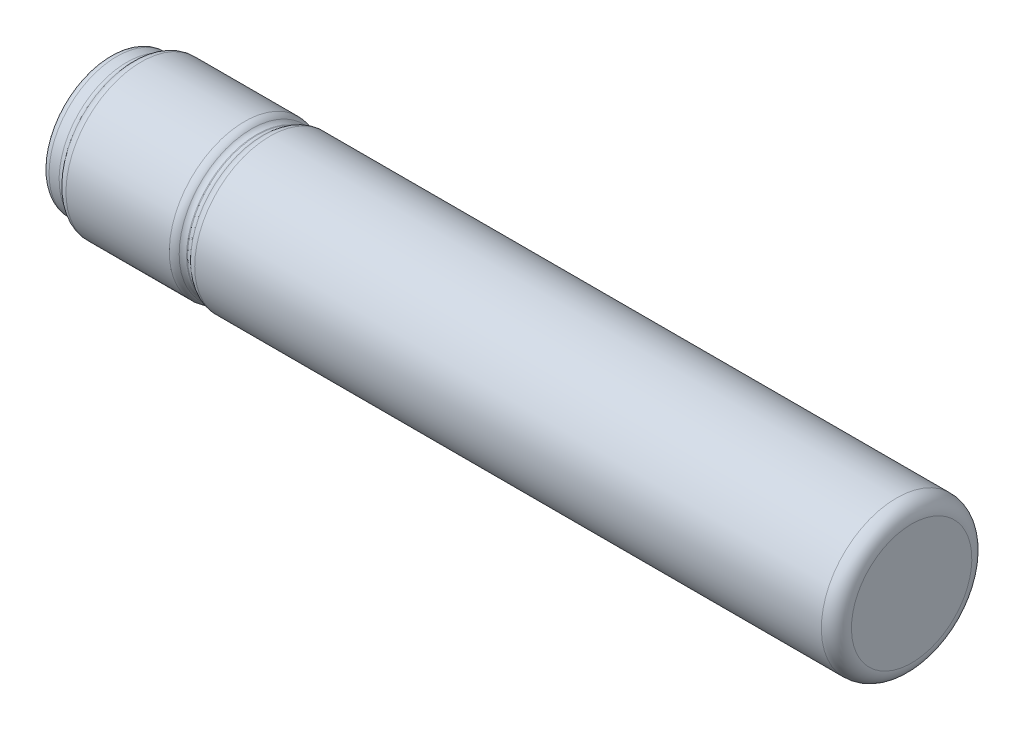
ISO-10303-21;
HEADER;
FILE_DESCRIPTION(('STEP AP214'),'2;1');
FILE_NAME('part.step','',(''),(''),'','','');
FILE_SCHEMA(('AUTOMOTIVE_DESIGN { 1 0 10303 214 1 1 1 1 }'));
ENDSEC;
DATA;
#1=APPLICATION_CONTEXT('core data for automotive mechanical design processes');
#2=APPLICATION_PROTOCOL_DEFINITION('international standard','automotive_design',2000,#1);
#3=PRODUCT_CONTEXT('',#1,'mechanical');
#4=PRODUCT('Part','Part','',(#3));
#5=PRODUCT_RELATED_PRODUCT_CATEGORY('part','',(#4));
#6=PRODUCT_DEFINITION_FORMATION('','',#4);
#7=PRODUCT_DEFINITION_CONTEXT('part definition',#1,'design');
#8=PRODUCT_DEFINITION('design','',#6,#7);
#9=PRODUCT_DEFINITION_SHAPE('','',#8);
#10=(LENGTH_UNIT() NAMED_UNIT(*) SI_UNIT(.MILLI.,.METRE.));
#11=(NAMED_UNIT(*) PLANE_ANGLE_UNIT() SI_UNIT($,.RADIAN.));
#12=(NAMED_UNIT(*) SI_UNIT($,.STERADIAN.) SOLID_ANGLE_UNIT());
#13=UNCERTAINTY_MEASURE_WITH_UNIT(LENGTH_MEASURE(1.E-05),#10,'distance_accuracy_value','');
#14=(GEOMETRIC_REPRESENTATION_CONTEXT(3) GLOBAL_UNCERTAINTY_ASSIGNED_CONTEXT((#13)) GLOBAL_UNIT_ASSIGNED_CONTEXT((#10,
#11,#12)) REPRESENTATION_CONTEXT('',''));
#15=CARTESIAN_POINT('',(0.,0.,0.));
#16=DIRECTION('',(0.,0.,1.));
#17=DIRECTION('',(1.,0.,0.));
#18=AXIS2_PLACEMENT_3D('',#15,#16,#17);
#19=CARTESIAN_POINT('',(0.,-2.9,0.));
#20=DIRECTION('',(-1.,0.,0.));
#21=DIRECTION('',(0.,-1.,0.));
#22=AXIS2_PLACEMENT_3D('',#19,#20,#21);
#23=PLANE('',#22);
#24=CARTESIAN_POINT('',(0.,0.,0.));
#25=DIRECTION('',(-1.,0.,0.));
#26=DIRECTION('',(0.,-1.,0.));
#27=AXIS2_PLACEMENT_3D('',#24,#25,#26);
#28=CIRCLE('',#27,2.89999999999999);
#29=CARTESIAN_POINT('',(0.,-2.9,0.));
#30=VERTEX_POINT('',#29);
#31=EDGE_CURVE('E86',#30,#30,#28,.F.);
#32=ORIENTED_EDGE('',*,*,#31,.T.);
#33=EDGE_LOOP('',(#32));
#34=FACE_BOUND('',#33,.T.);
#35=CARTESIAN_POINT('',(0.,0.,0.));
#36=DIRECTION('',(1.,0.,0.));
#37=DIRECTION('',(0.,1.,0.));
#38=AXIS2_PLACEMENT_3D('',#35,#36,#37);
#39=CIRCLE('',#38,4.74999999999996);
#40=CARTESIAN_POINT('',(0.,4.74999999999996,0.));
#41=VERTEX_POINT('',#40);
#42=EDGE_CURVE('E83',#41,#41,#39,.T.);
#43=ORIENTED_EDGE('',*,*,#42,.F.);
#44=EDGE_LOOP('',(#43));
#45=FACE_BOUND('',#44,.T.);
#46=ADVANCED_FACE('F33',(#34,#45),#23,.T.);
#47=CARTESIAN_POINT('',(79.4742369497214,0.,0.));
#48=DIRECTION('',(1.,0.,0.));
#49=DIRECTION('',(0.,1.,0.));
#50=AXIS2_PLACEMENT_3D('',#47,#48,#49);
#51=PLANE('',#50);
#52=CARTESIAN_POINT('',(79.4742369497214,0.,0.));
#53=DIRECTION('',(1.,0.,0.));
#54=DIRECTION('',(0.,1.,0.));
#55=AXIS2_PLACEMENT_3D('',#52,#53,#54);
#56=CIRCLE('',#55,5.99999999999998);
#57=CARTESIAN_POINT('',(79.4742369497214,5.99999999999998,0.));
#58=VERTEX_POINT('',#57);
#59=EDGE_CURVE('E77',#58,#58,#56,.T.);
#60=ORIENTED_EDGE('',*,*,#59,.T.);
#61=EDGE_LOOP('',(#60));
#62=FACE_BOUND('',#61,.T.);
#63=ADVANCED_FACE('F109',(#62),#51,.T.);
#64=CARTESIAN_POINT('',(79.4742369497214,0.,0.));
#65=DIRECTION('',(1.,0.,0.));
#66=DIRECTION('',(0.,1.,0.));
#67=AXIS2_PLACEMENT_3D('',#64,#65,#66);
#68=CYLINDRICAL_SURFACE('',#67,7.49999999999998);
#69=CARTESIAN_POINT('',(15.517638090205,0.,0.));
#70=DIRECTION('',(-1.,0.,0.));
#71=DIRECTION('',(0.,-1.,0.));
#72=AXIS2_PLACEMENT_3D('',#69,#70,#71);
#73=CIRCLE('',#72,7.49999999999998);
#74=CARTESIAN_POINT('',(15.517638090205,-7.49999999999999,0.));
#75=VERTEX_POINT('',#74);
#76=EDGE_CURVE('E40',#75,#75,#73,.F.);
#77=ORIENTED_EDGE('',*,*,#76,.T.);
#78=EDGE_LOOP('',(#77));
#79=FACE_BOUND('',#78,.T.);
#80=CARTESIAN_POINT('',(77.9742369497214,0.,0.));
#81=DIRECTION('',(1.,0.,0.));
#82=DIRECTION('',(0.,1.,0.));
#83=AXIS2_PLACEMENT_3D('',#80,#81,#82);
#84=CIRCLE('',#83,7.49999999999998);
#85=CARTESIAN_POINT('',(77.9742369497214,7.49999999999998,0.));
#86=VERTEX_POINT('',#85);
#87=EDGE_CURVE('E74',#86,#86,#84,.F.);
#88=ORIENTED_EDGE('',*,*,#87,.T.);
#89=EDGE_LOOP('',(#88));
#90=FACE_BOUND('',#89,.T.);
#91=ADVANCED_FACE('F115',(#79,#90),#68,.T.);
#92=CARTESIAN_POINT('',(79.4742369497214,0.,0.));
#93=DIRECTION('',(1.,0.,0.));
#94=DIRECTION('',(0.,1.,0.));
#95=AXIS2_PLACEMENT_3D('',#92,#93,#94);
#96=CYLINDRICAL_SURFACE('',#95,6.99999999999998);
#97=CARTESIAN_POINT('',(14.2928932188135,0.,0.));
#98=DIRECTION('',(1.,0.,0.));
#99=DIRECTION('',(0.,1.,0.));
#100=AXIS2_PLACEMENT_3D('',#97,#98,#99);
#101=CIRCLE('',#100,6.99999999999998);
#102=CARTESIAN_POINT('',(14.2928932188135,6.99999999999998,0.));
#103=VERTEX_POINT('',#102);
#104=EDGE_CURVE('E68',#103,#103,#101,.F.);
#105=ORIENTED_EDGE('',*,*,#104,.T.);
#106=EDGE_LOOP('',(#105));
#107=FACE_BOUND('',#106,.T.);
#108=CARTESIAN_POINT('',(14.2071067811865,0.,0.));
#109=DIRECTION('',(-1.,0.,0.));
#110=DIRECTION('',(0.,-1.,0.));
#111=AXIS2_PLACEMENT_3D('',#108,#109,#110);
#112=CIRCLE('',#111,6.99999999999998);
#113=CARTESIAN_POINT('',(14.2071067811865,-6.99999999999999,0.));
#114=VERTEX_POINT('',#113);
#115=EDGE_CURVE('E71',#114,#114,#112,.F.);
#116=ORIENTED_EDGE('',*,*,#115,.T.);
#117=EDGE_LOOP('',(#116));
#118=FACE_BOUND('',#117,.T.);
#119=ADVANCED_FACE('F154',(#107,#118),#96,.T.);
#120=CARTESIAN_POINT('',(79.4742369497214,0.,0.));
#121=DIRECTION('',(1.,0.,0.));
#122=DIRECTION('',(0.,1.,0.));
#123=AXIS2_PLACEMENT_3D('',#120,#121,#122);
#124=CYLINDRICAL_SURFACE('',#123,7.49999999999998);
#125=CARTESIAN_POINT('',(2.68614066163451,0.,0.));
#126=DIRECTION('',(-1.,0.,0.));
#127=DIRECTION('',(0.,-1.,0.));
#128=AXIS2_PLACEMENT_3D('',#125,#126,#127);
#129=CIRCLE('',#128,7.49999999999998);
#130=CARTESIAN_POINT('',(2.68614066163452,-7.49999999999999,0.));
#131=VERTEX_POINT('',#130);
#132=EDGE_CURVE('E53',#131,#131,#129,.F.);
#133=ORIENTED_EDGE('',*,*,#132,.T.);
#134=EDGE_LOOP('',(#133));
#135=FACE_BOUND('',#134,.T.);
#136=CARTESIAN_POINT('',(12.982361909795,0.,0.));
#137=DIRECTION('',(-1.,0.,0.));
#138=DIRECTION('',(0.,-1.,0.));
#139=AXIS2_PLACEMENT_3D('',#136,#137,#138);
#140=CIRCLE('',#139,7.49999999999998);
#141=CARTESIAN_POINT('',(12.982361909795,-7.49999999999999,0.));
#142=VERTEX_POINT('',#141);
#143=EDGE_CURVE('E56',#142,#142,#140,.T.);
#144=ORIENTED_EDGE('',*,*,#143,.T.);
#145=EDGE_LOOP('',(#144));
#146=FACE_BOUND('',#145,.T.);
#147=ADVANCED_FACE('F156',(#135,#146),#124,.T.);
#148=CARTESIAN_POINT('',(79.4742369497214,0.,0.));
#149=DIRECTION('',(1.,0.,0.));
#150=DIRECTION('',(0.,1.,0.));
#151=AXIS2_PLACEMENT_3D('',#148,#149,#150);
#152=CYLINDRICAL_SURFACE('',#151,6.74999999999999);
#153=CARTESIAN_POINT('',(0.25,0.,0.));
#154=DIRECTION('',(-1.,0.,0.));
#155=DIRECTION('',(0.,-1.,0.));
#156=AXIS2_PLACEMENT_3D('',#153,#154,#155);
#157=CIRCLE('',#156,6.74999999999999);
#158=CARTESIAN_POINT('',(0.250000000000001,-6.74999999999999,0.));
#159=VERTEX_POINT('',#158);
#160=EDGE_CURVE('E62',#159,#159,#157,.F.);
#161=ORIENTED_EDGE('',*,*,#160,.T.);
#162=EDGE_LOOP('',(#161));
#163=FACE_BOUND('',#162,.T.);
#164=CARTESIAN_POINT('',(1.25,0.,0.));
#165=DIRECTION('',(-1.,0.,0.));
#166=DIRECTION('',(0.,-1.,0.));
#167=AXIS2_PLACEMENT_3D('',#164,#165,#166);
#168=CIRCLE('',#167,6.74999999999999);
#169=CARTESIAN_POINT('',(1.25,-6.74999999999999,0.));
#170=VERTEX_POINT('',#169);
#171=EDGE_CURVE('E65',#170,#170,#168,.T.);
#172=ORIENTED_EDGE('',*,*,#171,.T.);
#173=EDGE_LOOP('',(#172));
#174=FACE_BOUND('',#173,.T.);
#175=ADVANCED_FACE('F163',(#163,#174),#152,.T.);
#176=CARTESIAN_POINT('',(-0.499999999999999,-4.74999999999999,0.));
#177=DIRECTION('',(-1.,0.,0.));
#178=DIRECTION('',(0.,-1.,0.));
#179=AXIS2_PLACEMENT_3D('',#176,#177,#178);
#180=PLANE('',#179);
#181=CARTESIAN_POINT('',(-0.5,0.,0.));
#182=DIRECTION('',(-1.,0.,0.));
#183=DIRECTION('',(0.,-1.,0.));
#184=AXIS2_PLACEMENT_3D('',#181,#182,#183);
#185=CIRCLE('',#184,5.99999999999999);
#186=CARTESIAN_POINT('',(-0.499999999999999,-5.99999999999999,0.));
#187=VERTEX_POINT('',#186);
#188=EDGE_CURVE('E59',#187,#187,#185,.T.);
#189=ORIENTED_EDGE('',*,*,#188,.T.);
#190=EDGE_LOOP('',(#189));
#191=FACE_BOUND('',#190,.T.);
#192=CARTESIAN_POINT('',(-0.5,0.,0.));
#193=DIRECTION('',(1.,0.,0.));
#194=DIRECTION('',(0.,1.,0.));
#195=AXIS2_PLACEMENT_3D('',#192,#193,#194);
#196=CIRCLE('',#195,4.74999999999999);
#197=CARTESIAN_POINT('',(-0.500000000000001,4.74999999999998,0.));
#198=VERTEX_POINT('',#197);
#199=EDGE_CURVE('E80',#198,#198,#196,.T.);
#200=ORIENTED_EDGE('',*,*,#199,.T.);
#201=EDGE_LOOP('',(#200));
#202=FACE_BOUND('',#201,.T.);
#203=ADVANCED_FACE('F169',(#191,#202),#180,.T.);
#204=CARTESIAN_POINT('',(79.4742369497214,0.,0.));
#205=DIRECTION('',(1.,0.,0.));
#206=DIRECTION('',(0.,1.,0.));
#207=AXIS2_PLACEMENT_3D('',#204,#205,#206);
#208=CYLINDRICAL_SURFACE('',#207,4.74999999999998);
#209=ORIENTED_EDGE('',*,*,#42,.T.);
#210=EDGE_LOOP('',(#209));
#211=FACE_BOUND('',#210,.T.);
#212=ORIENTED_EDGE('',*,*,#199,.F.);
#213=EDGE_LOOP('',(#212));
#214=FACE_BOUND('',#213,.T.);
#215=ADVANCED_FACE('F125',(#211,#214),#208,.F.);
#216=CARTESIAN_POINT('',(77.9742369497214,0.,0.));
#217=DIRECTION('',(1.,0.,0.));
#218=DIRECTION('',(0.,1.,0.));
#219=AXIS2_PLACEMENT_3D('',#216,#217,#218);
#220=TOROIDAL_SURFACE('',#219,5.99999999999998,1.5);
#221=ORIENTED_EDGE('',*,*,#87,.F.);
#222=EDGE_LOOP('',(#221));
#223=FACE_BOUND('',#222,.T.);
#224=ORIENTED_EDGE('',*,*,#59,.F.);
#225=EDGE_LOOP('',(#224));
#226=FACE_BOUND('',#225,.T.);
#227=ADVANCED_FACE('F121',(#223,#226),#220,.T.);
#228=CARTESIAN_POINT('',(14.2928932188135,0.,0.));
#229=DIRECTION('',(1.,0.,0.));
#230=DIRECTION('',(0.,1.,0.));
#231=AXIS2_PLACEMENT_3D('',#228,#229,#230);
#232=TOROIDAL_SURFACE('',#231,7.74999999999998,0.75);
#233=CARTESIAN_POINT('',(14.8177838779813,0.,0.));
#234=DIRECTION('',(-1.,0.,0.));
#235=DIRECTION('',(0.,-1.,0.));
#236=AXIS2_PLACEMENT_3D('',#233,#234,#235);
#237=CIRCLE('',#236,7.21428571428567);
#238=CARTESIAN_POINT('',(14.8177838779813,-7.21428571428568,0.));
#239=VERTEX_POINT('',#238);
#240=EDGE_CURVE('E10',#239,#239,#237,.T.);
#241=ORIENTED_EDGE('',*,*,#240,.T.);
#242=EDGE_LOOP('',(#241));
#243=FACE_BOUND('',#242,.T.);
#244=ORIENTED_EDGE('',*,*,#104,.F.);
#245=EDGE_LOOP('',(#244));
#246=FACE_BOUND('',#245,.T.);
#247=ADVANCED_FACE('F124',(#243,#246),#232,.F.);
#248=CARTESIAN_POINT('',(14.2071067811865,0.,0.));
#249=DIRECTION('',(-1.,0.,0.));
#250=DIRECTION('',(0.,-1.,0.));
#251=AXIS2_PLACEMENT_3D('',#248,#249,#250);
#252=TOROIDAL_SURFACE('',#251,7.74999999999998,0.75);
#253=CARTESIAN_POINT('',(13.6822161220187,0.,0.));
#254=DIRECTION('',(1.,0.,0.));
#255=DIRECTION('',(0.,1.,0.));
#256=AXIS2_PLACEMENT_3D('',#253,#254,#255);
#257=CIRCLE('',#256,7.2142857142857);
#258=CARTESIAN_POINT('',(13.6822161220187,7.21428571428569,0.));
#259=VERTEX_POINT('',#258);
#260=EDGE_CURVE('E44',#259,#259,#257,.T.);
#261=ORIENTED_EDGE('',*,*,#260,.T.);
#262=EDGE_LOOP('',(#261));
#263=FACE_BOUND('',#262,.T.);
#264=ORIENTED_EDGE('',*,*,#115,.F.);
#265=EDGE_LOOP('',(#264));
#266=FACE_BOUND('',#265,.T.);
#267=ADVANCED_FACE('F129',(#263,#266),#252,.F.);
#268=CARTESIAN_POINT('',(0.25,0.,0.));
#269=DIRECTION('',(-1.,0.,0.));
#270=DIRECTION('',(0.,-1.,0.));
#271=AXIS2_PLACEMENT_3D('',#268,#269,#270);
#272=TOROIDAL_SURFACE('',#271,5.99999999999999,0.75);
#273=ORIENTED_EDGE('',*,*,#188,.F.);
#274=EDGE_LOOP('',(#273));
#275=FACE_BOUND('',#274,.T.);
#276=ORIENTED_EDGE('',*,*,#160,.F.);
#277=EDGE_LOOP('',(#276));
#278=FACE_BOUND('',#277,.T.);
#279=ADVANCED_FACE('F132',(#275,#278),#272,.T.);
#280=CARTESIAN_POINT('',(1.25,0.,0.));
#281=DIRECTION('',(-1.,0.,0.));
#282=DIRECTION('',(0.,-1.,0.));
#283=AXIS2_PLACEMENT_3D('',#280,#281,#282);
#284=TOROIDAL_SURFACE('',#283,7.49999999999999,0.75);
#285=CARTESIAN_POINT('',(1.86548885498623,0.,0.));
#286=DIRECTION('',(-1.,0.,0.));
#287=DIRECTION('',(0.,-1.,0.));
#288=AXIS2_PLACEMENT_3D('',#285,#286,#287);
#289=CIRCLE('',#288,7.07142857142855);
#290=CARTESIAN_POINT('',(1.86548885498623,-7.07142857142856,0.));
#291=VERTEX_POINT('',#290);
#292=EDGE_CURVE('E48',#291,#291,#289,.T.);
#293=ORIENTED_EDGE('',*,*,#292,.T.);
#294=EDGE_LOOP('',(#293));
#295=FACE_BOUND('',#294,.T.);
#296=ORIENTED_EDGE('',*,*,#171,.F.);
#297=EDGE_LOOP('',(#296));
#298=FACE_BOUND('',#297,.T.);
#299=ADVANCED_FACE('F136',(#295,#298),#284,.F.);
#300=CARTESIAN_POINT('',(2.68614066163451,0.,0.));
#301=DIRECTION('',(-1.,0.,0.));
#302=DIRECTION('',(0.,-1.,0.));
#303=AXIS2_PLACEMENT_3D('',#300,#301,#302);
#304=TOROIDAL_SURFACE('',#303,6.49999999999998,1.);
#305=ORIENTED_EDGE('',*,*,#292,.F.);
#306=EDGE_LOOP('',(#305));
#307=FACE_BOUND('',#306,.T.);
#308=ORIENTED_EDGE('',*,*,#132,.F.);
#309=EDGE_LOOP('',(#308));
#310=FACE_BOUND('',#309,.T.);
#311=ADVANCED_FACE('F140',(#307,#310),#304,.T.);
#312=CARTESIAN_POINT('',(12.982361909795,0.,0.));
#313=DIRECTION('',(-1.,0.,0.));
#314=DIRECTION('',(0.,-1.,0.));
#315=AXIS2_PLACEMENT_3D('',#312,#313,#314);
#316=TOROIDAL_SURFACE('',#315,6.49999999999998,1.);
#317=ORIENTED_EDGE('',*,*,#143,.F.);
#318=EDGE_LOOP('',(#317));
#319=FACE_BOUND('',#318,.T.);
#320=ORIENTED_EDGE('',*,*,#260,.F.);
#321=EDGE_LOOP('',(#320));
#322=FACE_BOUND('',#321,.T.);
#323=ADVANCED_FACE('F104',(#319,#322),#316,.T.);
#324=CARTESIAN_POINT('',(15.517638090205,0.,0.));
#325=DIRECTION('',(-1.,0.,0.));
#326=DIRECTION('',(0.,-1.,0.));
#327=AXIS2_PLACEMENT_3D('',#324,#325,#326);
#328=TOROIDAL_SURFACE('',#327,6.49999999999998,1.);
#329=ORIENTED_EDGE('',*,*,#240,.F.);
#330=EDGE_LOOP('',(#329));
#331=FACE_BOUND('',#330,.T.);
#332=ORIENTED_EDGE('',*,*,#76,.F.);
#333=EDGE_LOOP('',(#332));
#334=FACE_BOUND('',#333,.T.);
#335=ADVANCED_FACE('F35',(#331,#334),#328,.T.);
#336=CARTESIAN_POINT('',(-1.48369182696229,0.,0.));
#337=DIRECTION('',(1.,0.,0.));
#338=DIRECTION('',(0.,1.,0.));
#339=AXIS2_PLACEMENT_3D('',#336,#337,#338);
#340=CYLINDRICAL_SURFACE('',#339,2.89999999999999);
#341=ORIENTED_EDGE('',*,*,#31,.F.);
#342=EDGE_LOOP('',(#341));
#343=FACE_BOUND('',#342,.T.);
#344=CARTESIAN_POINT('',(75.,0.,0.));
#345=DIRECTION('',(-1.,0.,0.));
#346=DIRECTION('',(0.,-1.,0.));
#347=AXIS2_PLACEMENT_3D('',#344,#345,#346);
#348=CIRCLE('',#347,2.89999999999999);
#349=CARTESIAN_POINT('',(75.,-2.89999999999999,0.));
#350=VERTEX_POINT('',#349);
#351=EDGE_CURVE('E89',#350,#350,#348,.T.);
#352=ORIENTED_EDGE('',*,*,#351,.F.);
#353=EDGE_LOOP('',(#352));
#354=FACE_BOUND('',#353,.T.);
#355=ADVANCED_FACE('F95',(#343,#354),#340,.F.);
#356=CARTESIAN_POINT('',(75.,0.,0.));
#357=DIRECTION('',(-1.,0.,0.));
#358=DIRECTION('',(0.,-1.,0.));
#359=AXIS2_PLACEMENT_3D('',#356,#357,#358);
#360=PLANE('',#359);
#361=ORIENTED_EDGE('',*,*,#351,.T.);
#362=EDGE_LOOP('',(#361));
#363=FACE_BOUND('',#362,.T.);
#364=ADVANCED_FACE('F93',(#363),#360,.T.);
#365=CLOSED_SHELL('',(#46,#63,#91,#119,#147,#175,#203,#215,#227,#247,#267,#279,#299,#311,#323,
#335,#355,#364));
#366=MANIFOLD_SOLID_BREP('B2',#365);
#367=ADVANCED_BREP_SHAPE_REPRESENTATION('',(#18,#366),#14);
#368=SHAPE_DEFINITION_REPRESENTATION(#9,#367);
ENDSEC;
END-ISO-10303-21;
